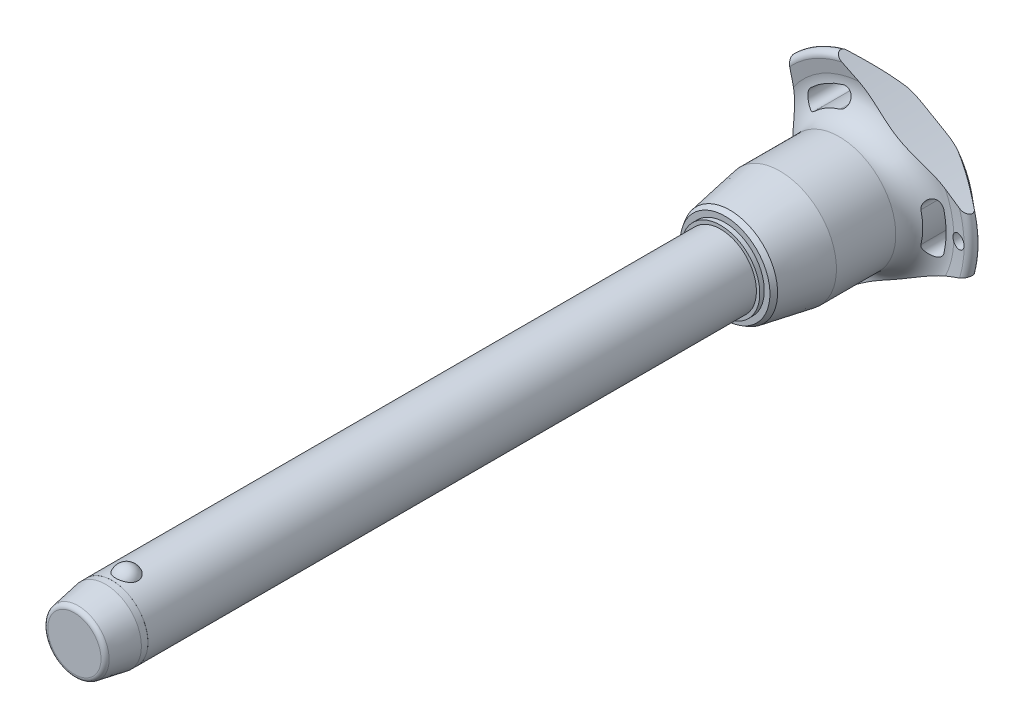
from build123d import *

# Parameters (mm, degrees)
SKETCH1_R           = 8
BOSS_EXTRUDE1_DEPTH = 130
SKETCH2_R           = 7
BOSS_EXTRUDE2_DEPTH = 39.7
BOSS_EXTRUDE3_START = 14
SKETCH1_2_R         = 8
BOSS_EXTRUDE3_DEPTH = 14
CHAMFER1_SIZE       = 7
CHAMFER1_SIZE2      = 1.234288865
FILLET1_R           = 1
SKETCH6_R           = 144.275
CUT_EXTRUDE1_DEPTH  = 174.008618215
CIRPATTERN1_COUNT   = 3
SKETCH7_R           = 1.5
CUT_EXTRUDE2_DEPTH  = 173.892579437
SKETCH8_R           = 8
SKETCH8_R_2         = 7.99
CUT_EXTRUDE3_DEPTH  = 8.4


with BuildPart() as part:
    # Sketch1 → Boss-Extrude1 (new body)
    with BuildSketch(Plane.XY):
        Circle(SKETCH1_R)
    extrude(amount=-BOSS_EXTRUDE1_DEPTH)

    # Sketch2 → Boss-Extrude2 (add)
    with BuildSketch(Plane(origin=(0, 0, -130), x_dir=(-1, 0, 0), z_dir=(0, 0, -1))):
        Circle(SKETCH2_R)
    extrude(amount=BOSS_EXTRUDE2_DEPTH)

    # Sketch3 → Revolve1 (revolve)
    with BuildSketch(Plane(origin=(0, 0, 0), x_dir=(0, 0, -1), z_dir=(1, 0, 0))):
        with BuildLine():
            Line((-2.387467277, 9.5), (-2.387467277, 4.2))
            ThreePointArc((-2.387467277, 4.2), (0.262532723, 6.85), (-2.387467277, 9.5))
        make_face()
        with BuildLine():
            Line((-2.387467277, -4.2), (-2.387467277, -9.5))
            ThreePointArc((-2.387467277, -9.5), (0.262532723, -6.85), (-2.387467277, -4.2))
        make_face()
    revolve(axis=Axis((0, -4.2, 2.387467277), (0, 1, 0)))

    # Sketch1_2 → Boss-Extrude3 (add)
    with BuildSketch(Plane.XY.offset(BOSS_EXTRUDE3_START)):
        Circle(SKETCH1_2_R)
    extrude(amount=-BOSS_EXTRUDE3_DEPTH)

    # Chamfer1
    chamfer1_edges = [part.edges().sort_by_distance(p)[0] for p in [
        (-8, 0, 14),
    ]]
    chamfer1_side = [part.faces().sort_by_distance(p)[0] for p in [
        (-8, 0, -58),
    ]]
    chamfer(chamfer1_edges, length=CHAMFER1_SIZE, length2=CHAMFER1_SIZE2, reference=chamfer1_side[0])

    # Fillet1
    fillet1_edges = [part.edges().sort_by_distance(p)[0] for p in [
        (-6.765711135, 0, 14),
        (7, 0, -169.7),
    ]]
    fillet(fillet1_edges, radius=FILLET1_R)

    # Sketch4 → Revolve2 (revolve)
    with BuildSketch(Plane(origin=(0, 0, 0), x_dir=(0, 0, -1), z_dir=(1, 0, 0)), mode=Mode.PRIVATE) as revolve2_sk:
        Polygon((130, 0), (130, 8.754868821), (131, 8.754868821), (131, 10.007796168), (132.085066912, 10.634259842), (143.233333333, 12.6), (156.466666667, 12.6), (156.466666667, 0), align=None)
    revolve(revolve2_sk.sketch.rotate(Axis((0, 0, -156.466666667), (0, 0, 1)), 90), axis=Axis((0, 0, -156.466666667), (0, 0, 1)))

    # Sketch5 → Revolve3 (revolve)
    with BuildSketch(Plane(origin=(0, 0, 0), x_dir=(0, 0, -1), z_dir=(1, 0, 0)), mode=Mode.PRIVATE) as revolve3_sk:
        with BuildLine():
            Line((162.379459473, 19.619255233), (161.900774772, 22.396148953))
            ThreePointArc((161.900774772, 22.396148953), (162.578274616, 23.688538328), (164.002586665, 23.371345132))
            Line((164.002586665, 23.371345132), (169.141488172, 17.247040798))
            ThreePointArc((169.141488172, 17.247040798), (169.7, 15.584758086), (168.978803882, 13.986322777))
            ThreePointArc((168.978803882, 13.986322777), (164.617427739, 7.589034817), (163.083333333, 0))
            Line((163.083333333, 0), (156.466666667, 0))
            Line((156.466666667, 0), (156.466666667, 12.6))
            ThreePointArc((156.466666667, 12.6), (161.055540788, 14.734481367), (162.379459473, 19.619255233))
        make_face()
    revolve(revolve3_sk.sketch.rotate(Axis((0, 0, -163.083333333), (0, 0, 1)), 90), axis=Axis((0, 0, -163.083333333), (0, 0, 1)))

    # Sketch6 → Cut-Extrude1 (cut, through all)
    with BuildSketch(Plane.XY):
        with Locations((-159.975, 0)):
            Circle(SKETCH6_R)
        with BuildLine():
            ThreePointArc((17.365443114, -4.192809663), (17.864441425, 0), (17.365443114, 4.192809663))
            ThreePointArc((17.365443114, 4.192809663), (15.247788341, 5.486749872), (13.953848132, 3.369095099))
            ThreePointArc((13.953848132, 3.369095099), (14.354813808, 0), (13.953848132, -3.369095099))
            ThreePointArc((13.953848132, -3.369095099), (15.247788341, -5.486749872), (17.365443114, -4.192809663))
        make_face()
    cut_extrude1 = extrude(amount=-CUT_EXTRUDE1_DEPTH, mode=Mode.SUBTRACT)

    # CirPattern1: Cut-Extrude1 ×3 about axis
    cirpattern1_axis = Axis((0, 0, 0), (0, 0, 1))
    for i in range(1, CIRPATTERN1_COUNT):
        add(cut_extrude1.rotate(cirpattern1_axis, i * 360 / CIRPATTERN1_COUNT), mode=Mode.SUBTRACT)

    # Sketch7 → Cut-Extrude2 (cut, through all)
    with BuildSketch(Plane.XY):
        with Locations(Location((20.864441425, 0, 0), (0, 0, 221.008319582))):
            Circle(SKETCH7_R)
    extrude(amount=-CUT_EXTRUDE2_DEPTH, mode=Mode.SUBTRACT)

    # Sketch8 → Cut-Extrude3 (cut)
    with BuildSketch(Plane.XY.offset(14)):
        Circle(SKETCH8_R)
        Circle(SKETCH8_R_2, mode=Mode.SUBTRACT)
    extrude(amount=-CUT_EXTRUDE3_DEPTH, mode=Mode.SUBTRACT)


solid = part.part
